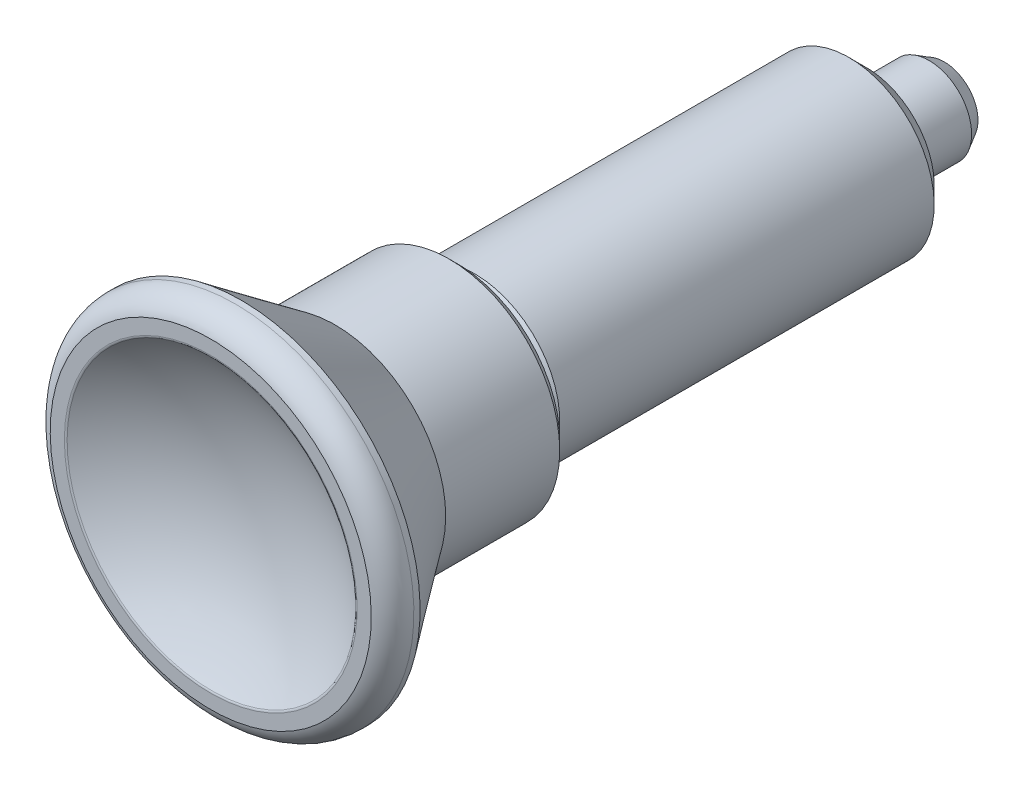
ISO-10303-21;
HEADER;
FILE_DESCRIPTION(('STEP AP214'),'2;1');
FILE_NAME('part.step','',(''),(''),'','','');
FILE_SCHEMA(('AUTOMOTIVE_DESIGN { 1 0 10303 214 1 1 1 1 }'));
ENDSEC;
DATA;
#1=APPLICATION_CONTEXT('core data for automotive mechanical design processes');
#2=APPLICATION_PROTOCOL_DEFINITION('international standard','automotive_design',2000,#1);
#3=PRODUCT_CONTEXT('',#1,'mechanical');
#4=PRODUCT('Part','Part','',(#3));
#5=PRODUCT_RELATED_PRODUCT_CATEGORY('part','',(#4));
#6=PRODUCT_DEFINITION_FORMATION('','',#4);
#7=PRODUCT_DEFINITION_CONTEXT('part definition',#1,'design');
#8=PRODUCT_DEFINITION('design','',#6,#7);
#9=PRODUCT_DEFINITION_SHAPE('','',#8);
#10=(LENGTH_UNIT() NAMED_UNIT(*) SI_UNIT(.MILLI.,.METRE.));
#11=(NAMED_UNIT(*) PLANE_ANGLE_UNIT() SI_UNIT($,.RADIAN.));
#12=(NAMED_UNIT(*) SI_UNIT($,.STERADIAN.) SOLID_ANGLE_UNIT());
#13=UNCERTAINTY_MEASURE_WITH_UNIT(LENGTH_MEASURE(1.E-05),#10,'distance_accuracy_value','');
#14=(GEOMETRIC_REPRESENTATION_CONTEXT(3) GLOBAL_UNCERTAINTY_ASSIGNED_CONTEXT((#13)) GLOBAL_UNIT_ASSIGNED_CONTEXT((#10,
#11,#12)) REPRESENTATION_CONTEXT('',''));
#15=CARTESIAN_POINT('',(0.,0.,0.));
#16=DIRECTION('',(0.,0.,1.));
#17=DIRECTION('',(1.,0.,0.));
#18=AXIS2_PLACEMENT_3D('',#15,#16,#17);
#19=CARTESIAN_POINT('',(-4.42791074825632E-10,6.64607258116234E-11,1.52503010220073E-10));
#20=DIRECTION('',(-0.923728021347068,-0.383049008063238,0.));
#21=DIRECTION('',(0.,0.,-1.));
#22=AXIS2_PLACEMENT_3D('',#19,#20,#21);
#23=SPHERICAL_SURFACE('',#22,5.);
#24=CARTESIAN_POINT('',(0.,0.,-4.58812253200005));
#25=DIRECTION('',(0.,0.,1.));
#26=DIRECTION('',(0.923728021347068,0.383049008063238,0.));
#27=AXIS2_PLACEMENT_3D('',#24,#25,#26);
#28=CIRCLE('',#27,1.987242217);
#29=CARTESIAN_POINT('',(-1.83428256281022,-0.764551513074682,-4.5881225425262));
#30=VERTEX_POINT('',#29);
#31=CARTESIAN_POINT('',(1.8370555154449,0.757868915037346,-4.5881218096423));
#32=VERTEX_POINT('',#31);
#33=EDGE_CURVE('E42',#30,#32,#28,.T.);
#34=ORIENTED_EDGE('',*,*,#33,.F.);
#35=CARTESIAN_POINT('',(-1.83566823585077,-0.761209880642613,0.));
#36=DIRECTION('',(-0.923728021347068,-0.383049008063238,0.));
#37=DIRECTION('',(-1.92852821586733E-11,4.65064313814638E-11,1.));
#38=AXIS2_PLACEMENT_3D('',#35,#36,#37);
#39=CIRCLE('',#38,4.58812397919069);
#40=CARTESIAN_POINT('',(-1.83567054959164,-0.761210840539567,-4.58812289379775));
#41=VERTEX_POINT('',#40);
#42=EDGE_CURVE('E39',#30,#41,#39,.F.);
#43=ORIENTED_EDGE('',*,*,#42,.T.);
#44=CARTESIAN_POINT('',(0.,0.,-4.58812253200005));
#45=DIRECTION('',(0.,0.,1.));
#46=DIRECTION('',(0.923728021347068,0.383049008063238,0.));
#47=AXIS2_PLACEMENT_3D('',#44,#45,#46);
#48=CIRCLE('',#47,1.987242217);
#49=CARTESIAN_POINT('',(1.83567134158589,0.76121116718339,-4.58812252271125));
#50=VERTEX_POINT('',#49);
#51=EDGE_CURVE('E18',#50,#41,#48,.T.);
#52=ORIENTED_EDGE('',*,*,#51,.F.);
#53=CARTESIAN_POINT('',(1.83567136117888,0.761211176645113,0.));
#54=DIRECTION('',(-0.923728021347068,-0.383049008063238,0.));
#55=DIRECTION('',(-1.92852883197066E-11,4.65064462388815E-11,1.));
#56=AXIS2_PLACEMENT_3D('',#53,#54,#55);
#57=CIRCLE('',#56,4.58812251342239);
#58=EDGE_CURVE('E32',#50,#32,#57,.T.);
#59=ORIENTED_EDGE('',*,*,#58,.T.);
#60=EDGE_LOOP('',(#34,#43,#52,#59));
#61=FACE_BOUND('',#60,.T.);
#62=ADVANCED_FACE('F14',(#61),#23,.T.);
#63=CARTESIAN_POINT('',(0.,0.,-4.58812253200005));
#64=DIRECTION('',(0.,0.,1.));
#65=DIRECTION('',(0.923728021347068,0.383049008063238,0.));
#66=AXIS2_PLACEMENT_3D('',#63,#64,#65);
#67=CONICAL_SURFACE('',#66,1.987242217,0.523598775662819);
#68=ORIENTED_EDGE('',*,*,#51,.T.);
#69=ORIENTED_EDGE('',*,*,#42,.F.);
#70=ORIENTED_EDGE('',*,*,#33,.T.);
#71=ORIENTED_EDGE('',*,*,#58,.F.);
#72=EDGE_LOOP('',(#68,#69,#70,#71));
#73=FACE_BOUND('',#72,.T.);
#74=CARTESIAN_POINT('',(0.,0.,-3.7));
#75=DIRECTION('',(0.,0.,-1.));
#76=DIRECTION('',(-0.923728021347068,-0.383049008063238,0.));
#77=AXIS2_PLACEMENT_3D('',#74,#75,#76);
#78=CIRCLE('',#77,2.5);
#79=CARTESIAN_POINT('',(-2.30932005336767,-0.957622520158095,-3.7));
#80=VERTEX_POINT('',#79);
#81=EDGE_CURVE('E47',#80,#80,#78,.F.);
#82=ORIENTED_EDGE('',*,*,#81,.F.);
#83=EDGE_LOOP('',(#82));
#84=FACE_BOUND('',#83,.T.);
#85=ADVANCED_FACE('F45',(#73,#84),#67,.T.);
#86=CARTESIAN_POINT('',(0.,0.,0.));
#87=DIRECTION('',(0.,0.,-1.));
#88=DIRECTION('',(-0.923728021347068,-0.383049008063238,0.));
#89=AXIS2_PLACEMENT_3D('',#86,#87,#88);
#90=CYLINDRICAL_SURFACE('',#89,2.5);
#91=CARTESIAN_POINT('',(0.,0.,0.));
#92=DIRECTION('',(0.,0.,-1.));
#93=DIRECTION('',(-0.923728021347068,-0.383049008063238,0.));
#94=AXIS2_PLACEMENT_3D('',#91,#92,#93);
#95=CIRCLE('',#94,2.5);
#96=CARTESIAN_POINT('',(-2.30932005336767,-0.957622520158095,0.));
#97=VERTEX_POINT('',#96);
#98=EDGE_CURVE('E339',#97,#97,#95,.F.);
#99=ORIENTED_EDGE('',*,*,#98,.F.);
#100=EDGE_LOOP('',(#99));
#101=FACE_BOUND('',#100,.T.);
#102=ORIENTED_EDGE('',*,*,#81,.T.);
#103=EDGE_LOOP('',(#102));
#104=FACE_BOUND('',#103,.T.);
#105=ADVANCED_FACE('F64',(#101,#104),#90,.T.);
#106=CARTESIAN_POINT('',(5.29516892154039,-2.20153529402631,0.));
#107=DIRECTION('',(0.,0.,-1.));
#108=DIRECTION('',(-0.923728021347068,-0.383049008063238,0.));
#109=AXIS2_PLACEMENT_3D('',#106,#107,#108);
#110=PLANE('',#109);
#111=ORIENTED_EDGE('',*,*,#98,.T.);
#112=EDGE_LOOP('',(#111));
#113=FACE_BOUND('',#112,.T.);
#114=CARTESIAN_POINT('',(0.,0.,0.));
#115=DIRECTION('',(0.,0.,1.));
#116=DIRECTION('',(0.923728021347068,0.383049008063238,0.));
#117=AXIS2_PLACEMENT_3D('',#114,#115,#116);
#118=CIRCLE('',#117,4.0000000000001);
#119=CARTESIAN_POINT('',(3.69491208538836,1.53219603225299,0.));
#120=VERTEX_POINT('',#119);
#121=EDGE_CURVE('E342',#120,#120,#118,.T.);
#122=ORIENTED_EDGE('',*,*,#121,.F.);
#123=EDGE_LOOP('',(#122));
#124=FACE_BOUND('',#123,.T.);
#125=ADVANCED_FACE('F67',(#113,#124),#110,.T.);
#126=CARTESIAN_POINT('',(0.,0.,0.));
#127=DIRECTION('',(0.,0.,1.));
#128=DIRECTION('',(0.923728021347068,0.383049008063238,0.));
#129=AXIS2_PLACEMENT_3D('',#126,#127,#128);
#130=CONICAL_SURFACE('',#129,4.,0.785398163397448);
#131=CARTESIAN_POINT('',(0.,0.,1.));
#132=DIRECTION('',(0.,0.,-1.));
#133=DIRECTION('',(-0.923728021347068,-0.383049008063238,0.));
#134=AXIS2_PLACEMENT_3D('',#131,#132,#133);
#135=CIRCLE('',#134,5.);
#136=CARTESIAN_POINT('',(-4.61864010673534,-1.91524504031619,0.999999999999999));
#137=VERTEX_POINT('',#136);
#138=EDGE_CURVE('E344',#137,#137,#135,.F.);
#139=ORIENTED_EDGE('',*,*,#138,.F.);
#140=EDGE_LOOP('',(#139));
#141=FACE_BOUND('',#140,.T.);
#142=ORIENTED_EDGE('',*,*,#121,.T.);
#143=EDGE_LOOP('',(#142));
#144=FACE_BOUND('',#143,.T.);
#145=ADVANCED_FACE('F69',(#141,#144),#130,.T.);
#146=CARTESIAN_POINT('',(0.,0.,23.));
#147=DIRECTION('',(0.,0.,-1.));
#148=DIRECTION('',(-0.923728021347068,-0.383049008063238,0.));
#149=AXIS2_PLACEMENT_3D('',#146,#147,#148);
#150=CYLINDRICAL_SURFACE('',#149,5.);
#151=ORIENTED_EDGE('',*,*,#138,.T.);
#152=EDGE_LOOP('',(#151));
#153=FACE_BOUND('',#152,.T.);
#154=CARTESIAN_POINT('',(0.,0.,23.));
#155=DIRECTION('',(0.,0.,-1.));
#156=DIRECTION('',(-0.923728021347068,-0.383049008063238,0.));
#157=AXIS2_PLACEMENT_3D('',#154,#155,#156);
#158=CIRCLE('',#157,5.);
#159=CARTESIAN_POINT('',(-4.61864010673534,-1.91524504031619,22.9999999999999));
#160=VERTEX_POINT('',#159);
#161=EDGE_CURVE('E24',#160,#160,#158,.F.);
#162=ORIENTED_EDGE('',*,*,#161,.F.);
#163=EDGE_LOOP('',(#162));
#164=FACE_BOUND('',#163,.T.);
#165=ADVANCED_FACE('F72',(#153,#164),#150,.T.);
#166=CARTESIAN_POINT('',(0.,0.,24.));
#167=DIRECTION('',(0.,0.,-1.));
#168=DIRECTION('',(-0.923728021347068,-0.383049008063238,0.));
#169=AXIS2_PLACEMENT_3D('',#166,#167,#168);
#170=CONICAL_SURFACE('',#169,4.,0.785398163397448);
#171=ORIENTED_EDGE('',*,*,#161,.T.);
#172=EDGE_LOOP('',(#171));
#173=FACE_BOUND('',#172,.T.);
#174=CARTESIAN_POINT('',(0.,0.,24.));
#175=DIRECTION('',(0.,0.,-1.));
#176=DIRECTION('',(-0.923728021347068,-0.383049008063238,0.));
#177=AXIS2_PLACEMENT_3D('',#174,#175,#176);
#178=CIRCLE('',#177,4.);
#179=CARTESIAN_POINT('',(-3.69491208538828,-1.53219603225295,24.));
#180=VERTEX_POINT('',#179);
#181=EDGE_CURVE('E9',#180,#180,#178,.T.);
#182=ORIENTED_EDGE('',*,*,#181,.T.);
#183=EDGE_LOOP('',(#182));
#184=FACE_BOUND('',#183,.T.);
#185=ADVANCED_FACE('F76',(#173,#184),#170,.T.);
#186=CARTESIAN_POINT('',(0.,0.,49.6055276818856));
#187=DIRECTION('',(0.,0.,-1.));
#188=DIRECTION('',(-0.923728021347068,-0.383049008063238,0.));
#189=AXIS2_PLACEMENT_3D('',#186,#187,#188);
#190=SPHERICAL_SURFACE('',#189,14.0000000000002);
#191=CARTESIAN_POINT('',(0.,0.,38.4646826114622));
#192=DIRECTION('',(0.,0.,-1.));
#193=DIRECTION('',(-0.923728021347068,-0.383049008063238,0.));
#194=AXIS2_PLACEMENT_3D('',#191,#192,#193);
#195=CIRCLE('',#194,8.47830001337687);
#196=CARTESIAN_POINT('',(-7.83164329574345,-3.24760441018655,38.4646826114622));
#197=VERTEX_POINT('',#196);
#198=EDGE_CURVE('E50',#197,#197,#195,.T.);
#199=ORIENTED_EDGE('',*,*,#198,.F.);
#200=EDGE_LOOP('',(#199));
#201=FACE_BOUND('',#200,.T.);
#202=ADVANCED_FACE('F60',(#201),#190,.F.);
#203=CARTESIAN_POINT('',(0.,0.,38.3055276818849));
#204=DIRECTION('',(0.,0.,-1.));
#205=DIRECTION('',(-1.,0.,0.));
#206=AXIS2_PLACEMENT_3D('',#203,#204,#205);
#207=TOROIDAL_SURFACE('',#206,8.59941858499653,0.199999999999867);
#208=ORIENTED_EDGE('',*,*,#198,.T.);
#209=EDGE_LOOP('',(#208));
#210=FACE_BOUND('',#209,.T.);
#211=CARTESIAN_POINT('',(0.,0.,38.5055276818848));
#212=DIRECTION('',(0.,0.,1.));
#213=DIRECTION('',(-0.923728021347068,-0.383049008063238,0.));
#214=AXIS2_PLACEMENT_3D('',#211,#212,#213);
#215=CIRCLE('',#214,8.59941858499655);
#216=CARTESIAN_POINT('',(-7.94352391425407,-3.2939987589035,38.5055276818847));
#217=VERTEX_POINT('',#216);
#218=EDGE_CURVE('E101',#217,#217,#215,.T.);
#219=ORIENTED_EDGE('',*,*,#218,.T.);
#220=EDGE_LOOP('',(#219));
#221=FACE_BOUND('',#220,.T.);
#222=ADVANCED_FACE('F83',(#210,#221),#207,.T.);
#223=CARTESIAN_POINT('',(5.60947778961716,13.5576498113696,38.5055276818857));
#224=DIRECTION('',(0.,0.,1.));
#225=DIRECTION('',(-0.923728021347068,-0.383049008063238,0.));
#226=AXIS2_PLACEMENT_3D('',#223,#224,#225);
#227=PLANE('',#226);
#228=CARTESIAN_POINT('',(0.,0.,38.5055276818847));
#229=DIRECTION('',(0.,0.,-1.));
#230=DIRECTION('',(-0.923728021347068,-0.383049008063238,0.));
#231=AXIS2_PLACEMENT_3D('',#228,#229,#230);
#232=CIRCLE('',#231,9.43170557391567);
#233=CARTESIAN_POINT('',(-8.71233072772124,-3.61280546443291,38.5055276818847));
#234=VERTEX_POINT('',#233);
#235=EDGE_CURVE('E108',#234,#234,#232,.T.);
#236=ORIENTED_EDGE('',*,*,#235,.F.);
#237=EDGE_LOOP('',(#236));
#238=FACE_BOUND('',#237,.T.);
#239=ORIENTED_EDGE('',*,*,#218,.F.);
#240=EDGE_LOOP('',(#239));
#241=FACE_BOUND('',#240,.T.);
#242=ADVANCED_FACE('F85',(#238,#241),#227,.T.);
#243=CARTESIAN_POINT('',(0.,0.,37.0689935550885));
#244=DIRECTION('',(0.,0.,-1.));
#245=DIRECTION('',(-1.,0.,0.));
#246=AXIS2_PLACEMENT_3D('',#243,#244,#245);
#247=TOROIDAL_SURFACE('',#246,9.00000000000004,1.49999999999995);
#248=ORIENTED_EDGE('',*,*,#235,.T.);
#249=EDGE_LOOP('',(#248));
#250=FACE_BOUND('',#249,.T.);
#251=CARTESIAN_POINT('',(0.,0.,37.0689935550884));
#252=DIRECTION('',(0.,0.,-1.));
#253=DIRECTION('',(-0.923728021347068,-0.383049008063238,0.));
#254=AXIS2_PLACEMENT_3D('',#251,#252,#253);
#255=CIRCLE('',#254,10.5);
#256=CARTESIAN_POINT('',(-9.69914422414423,-4.022014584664,37.0689935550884));
#257=VERTEX_POINT('',#256);
#258=EDGE_CURVE('E113',#257,#257,#255,.T.);
#259=ORIENTED_EDGE('',*,*,#258,.F.);
#260=EDGE_LOOP('',(#259));
#261=FACE_BOUND('',#260,.T.);
#262=ADVANCED_FACE('F16',(#250,#261),#247,.T.);
#263=CARTESIAN_POINT('',(0.,0.,37.0689935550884));
#264=DIRECTION('',(0.,0.,-1.));
#265=DIRECTION('',(-0.923728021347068,-0.383049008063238,0.));
#266=AXIS2_PLACEMENT_3D('',#263,#264,#265);
#267=CYLINDRICAL_SURFACE('',#266,10.5);
#268=ORIENTED_EDGE('',*,*,#258,.T.);
#269=EDGE_LOOP('',(#268));
#270=FACE_BOUND('',#269,.T.);
#271=CARTESIAN_POINT('',(0.,0.,36.7055276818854));
#272=DIRECTION('',(0.,0.,-1.));
#273=DIRECTION('',(-0.923728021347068,-0.383049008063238,0.));
#274=AXIS2_PLACEMENT_3D('',#271,#272,#273);
#275=CIRCLE('',#274,10.5);
#276=CARTESIAN_POINT('',(-9.69914422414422,-4.022014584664,36.7055276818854));
#277=VERTEX_POINT('',#276);
#278=EDGE_CURVE('E117',#277,#277,#275,.T.);
#279=ORIENTED_EDGE('',*,*,#278,.F.);
#280=EDGE_LOOP('',(#279));
#281=FACE_BOUND('',#280,.T.);
#282=ADVANCED_FACE('F158',(#270,#281),#267,.T.);
#283=CARTESIAN_POINT('',(0.,0.,31.2));
#284=DIRECTION('',(0.,0.,1.));
#285=DIRECTION('',(-0.923728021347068,-0.383049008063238,0.));
#286=AXIS2_PLACEMENT_3D('',#283,#284,#285);
#287=CONICAL_SURFACE('',#286,6.5,0.628318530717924);
#288=ORIENTED_EDGE('',*,*,#278,.T.);
#289=EDGE_LOOP('',(#288));
#290=FACE_BOUND('',#289,.T.);
#291=CARTESIAN_POINT('',(0.,0.,31.2));
#292=DIRECTION('',(0.,0.,-1.));
#293=DIRECTION('',(-0.923728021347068,-0.383049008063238,0.));
#294=AXIS2_PLACEMENT_3D('',#291,#292,#293);
#295=CIRCLE('',#294,6.5);
#296=CARTESIAN_POINT('',(-6.00423213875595,-2.48981855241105,31.2));
#297=VERTEX_POINT('',#296);
#298=EDGE_CURVE('E121',#297,#297,#295,.T.);
#299=ORIENTED_EDGE('',*,*,#298,.F.);
#300=EDGE_LOOP('',(#299));
#301=FACE_BOUND('',#300,.T.);
#302=ADVANCED_FACE('F151',(#290,#301),#287,.T.);
#303=CARTESIAN_POINT('',(0.,0.,31.2));
#304=DIRECTION('',(0.,0.,-1.));
#305=DIRECTION('',(-0.923728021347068,-0.383049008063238,0.));
#306=AXIS2_PLACEMENT_3D('',#303,#304,#305);
#307=CYLINDRICAL_SURFACE('',#306,6.5);
#308=CARTESIAN_POINT('',(0.,0.,24.5));
#309=DIRECTION('',(0.,0.,1.));
#310=DIRECTION('',(-0.923728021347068,-0.383049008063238,0.));
#311=AXIS2_PLACEMENT_3D('',#308,#309,#310);
#312=CIRCLE('',#311,6.5);
#313=CARTESIAN_POINT('',(-6.00423213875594,-2.48981855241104,24.5));
#314=VERTEX_POINT('',#313);
#315=EDGE_CURVE('E125',#314,#314,#312,.T.);
#316=ORIENTED_EDGE('',*,*,#315,.T.);
#317=EDGE_LOOP('',(#316));
#318=FACE_BOUND('',#317,.T.);
#319=ORIENTED_EDGE('',*,*,#298,.T.);
#320=EDGE_LOOP('',(#319));
#321=FACE_BOUND('',#320,.T.);
#322=ADVANCED_FACE('F141',(#318,#321),#307,.T.);
#323=CARTESIAN_POINT('',(0.,0.,24.));
#324=DIRECTION('',(0.,0.,1.));
#325=DIRECTION('',(-0.923728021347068,-0.383049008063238,0.));
#326=AXIS2_PLACEMENT_3D('',#323,#324,#325);
#327=CONICAL_SURFACE('',#326,6.,0.785398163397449);
#328=ORIENTED_EDGE('',*,*,#315,.F.);
#329=EDGE_LOOP('',(#328));
#330=FACE_BOUND('',#329,.T.);
#331=CARTESIAN_POINT('',(0.,0.,24.));
#332=DIRECTION('',(0.,0.,-1.));
#333=DIRECTION('',(-0.923728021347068,-0.383049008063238,0.));
#334=AXIS2_PLACEMENT_3D('',#331,#332,#333);
#335=CIRCLE('',#334,6.);
#336=CARTESIAN_POINT('',(-5.54236812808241,-2.29829404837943,24.));
#337=VERTEX_POINT('',#336);
#338=EDGE_CURVE('E43',#337,#337,#335,.T.);
#339=ORIENTED_EDGE('',*,*,#338,.F.);
#340=EDGE_LOOP('',(#339));
#341=FACE_BOUND('',#340,.T.);
#342=ADVANCED_FACE('F139',(#330,#341),#327,.T.);
#343=CARTESIAN_POINT('',(9.34345576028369,-3.86585494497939,24.));
#344=DIRECTION('',(0.,0.,-1.));
#345=DIRECTION('',(-0.923728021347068,-0.383049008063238,0.));
#346=AXIS2_PLACEMENT_3D('',#343,#344,#345);
#347=PLANE('',#346);
#348=ORIENTED_EDGE('',*,*,#338,.T.);
#349=EDGE_LOOP('',(#348));
#350=FACE_BOUND('',#349,.T.);
#351=ORIENTED_EDGE('',*,*,#181,.F.);
#352=EDGE_LOOP('',(#351));
#353=FACE_BOUND('',#352,.T.);
#354=ADVANCED_FACE('F136',(#350,#353),#347,.T.);
#355=CLOSED_SHELL('',(#62,#85,#105,#125,#145,#165,#185,#202,#222,#242,#262,#282,#302,#322,#342,#354));
#356=MANIFOLD_SOLID_BREP('B1',#355);
#357=ADVANCED_BREP_SHAPE_REPRESENTATION('',(#18,#356),#14);
#358=SHAPE_DEFINITION_REPRESENTATION(#9,#357);
ENDSEC;
END-ISO-10303-21;
